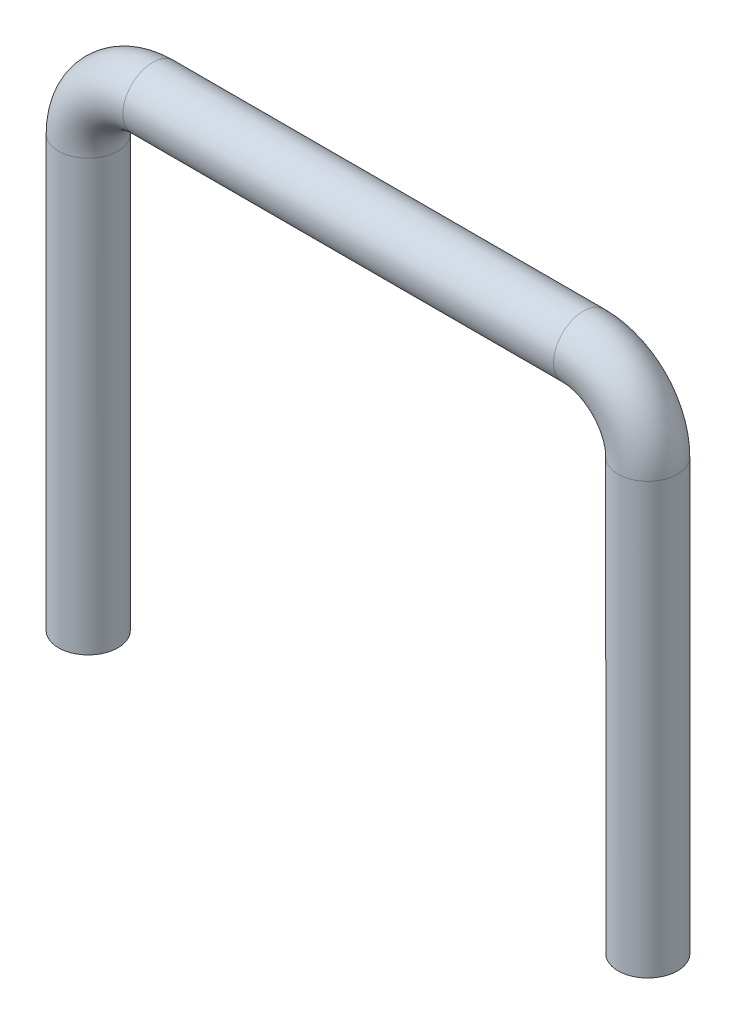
from build123d import *

# Parameters (mm, degrees)
ESQUISSE2_R   = 30
ESQUISSE2_R_2 = 8


with BuildPart() as part:
    # Base-Balayage: sweep along a path in Esquisse1
    with BuildLine(Plane.XY) as base_balayage_path:
        Line((0, 0), (0, 434))
        ThreePointArc((0, 434), (19.038059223, 479.961940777), (65, 499))
        Line((65, 499), (499.55, 499))
        ThreePointArc((499.55, 499), (545.511940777, 479.961940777), (564.55, 434))
        Line((564.55, 434), (564.55, 0))
    # Esquisse2 → Base-Balayage (sweep)
    with BuildSketch(Plane(origin=(0, 0, 0), x_dir=(1, 0, 0), z_dir=(0, 1, 0))):
        Circle(ESQUISSE2_R)
        Circle(ESQUISSE2_R_2, mode=Mode.SUBTRACT)
    sweep(path=base_balayage_path.line)


solid = part.part
